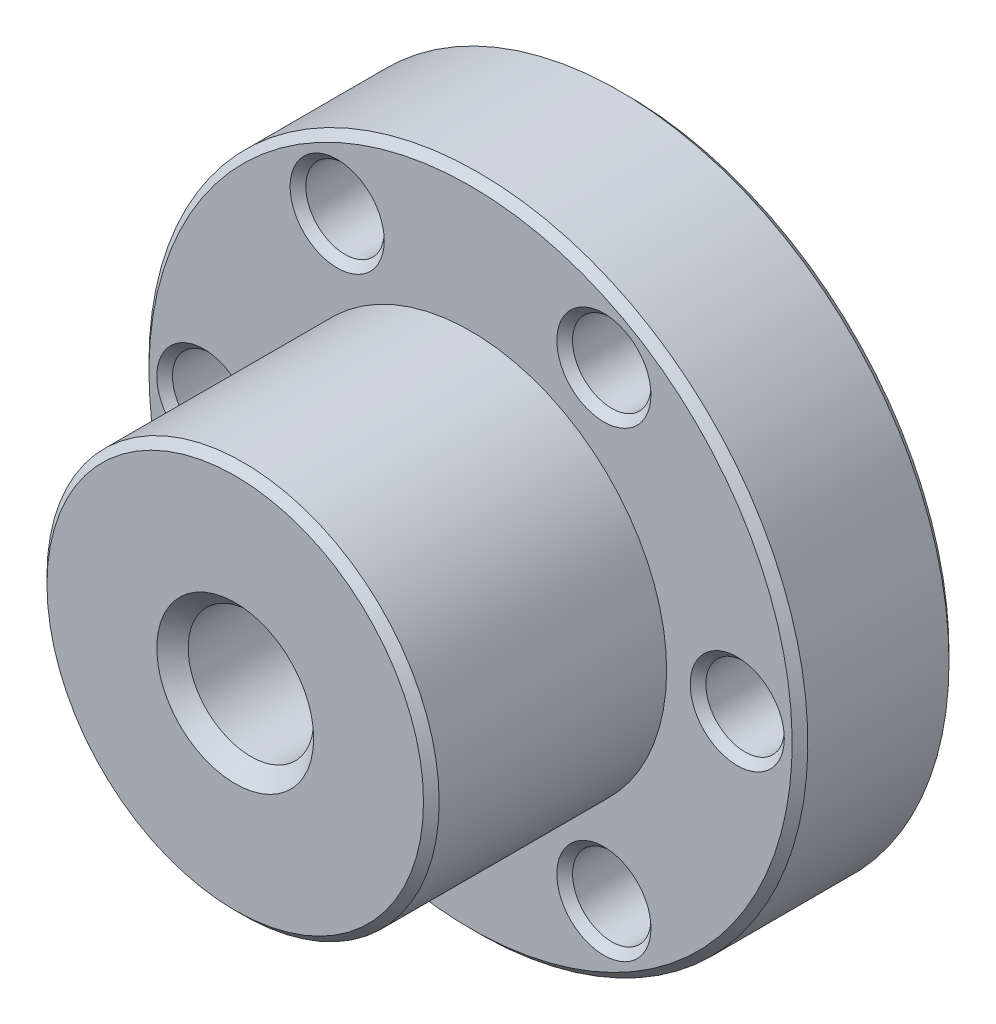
ISO-10303-21;
HEADER;
FILE_DESCRIPTION(('STEP AP214'),'2;1');
FILE_NAME('part.step','',(''),(''),'','','');
FILE_SCHEMA(('AUTOMOTIVE_DESIGN { 1 0 10303 214 1 1 1 1 }'));
ENDSEC;
DATA;
#1=APPLICATION_CONTEXT('core data for automotive mechanical design processes');
#2=APPLICATION_PROTOCOL_DEFINITION('international standard','automotive_design',2000,#1);
#3=PRODUCT_CONTEXT('',#1,'mechanical');
#4=PRODUCT('Part','Part','',(#3));
#5=PRODUCT_RELATED_PRODUCT_CATEGORY('part','',(#4));
#6=PRODUCT_DEFINITION_FORMATION('','',#4);
#7=PRODUCT_DEFINITION_CONTEXT('part definition',#1,'design');
#8=PRODUCT_DEFINITION('design','',#6,#7);
#9=PRODUCT_DEFINITION_SHAPE('','',#8);
#10=(LENGTH_UNIT() NAMED_UNIT(*) SI_UNIT(.MILLI.,.METRE.));
#11=(NAMED_UNIT(*) PLANE_ANGLE_UNIT() SI_UNIT($,.RADIAN.));
#12=(NAMED_UNIT(*) SI_UNIT($,.STERADIAN.) SOLID_ANGLE_UNIT());
#13=UNCERTAINTY_MEASURE_WITH_UNIT(LENGTH_MEASURE(1.E-05),#10,'distance_accuracy_value','');
#14=(GEOMETRIC_REPRESENTATION_CONTEXT(3) GLOBAL_UNCERTAINTY_ASSIGNED_CONTEXT((#13)) GLOBAL_UNIT_ASSIGNED_CONTEXT((#10,
#11,#12)) REPRESENTATION_CONTEXT('',''));
#15=CARTESIAN_POINT('',(0.,0.,0.));
#16=DIRECTION('',(0.,0.,1.));
#17=DIRECTION('',(1.,0.,0.));
#18=AXIS2_PLACEMENT_3D('',#15,#16,#17);
#19=CARTESIAN_POINT('',(0.,0.,12.));
#20=DIRECTION('',(0.,0.,-1.));
#21=DIRECTION('',(-1.,0.,0.));
#22=AXIS2_PLACEMENT_3D('',#19,#20,#21);
#23=CONICAL_SURFACE('',#22,12.5,0.785398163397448);
#24=CARTESIAN_POINT('',(0.,0.,12.));
#25=DIRECTION('',(0.,0.,-1.));
#26=DIRECTION('',(-1.,0.,0.));
#27=AXIS2_PLACEMENT_3D('',#24,#25,#26);
#28=CIRCLE('',#27,12.5);
#29=CARTESIAN_POINT('',(-12.5,0.,12.));
#30=VERTEX_POINT('',#29);
#31=EDGE_CURVE('E30',#30,#30,#28,.T.);
#32=ORIENTED_EDGE('',*,*,#31,.F.);
#33=EDGE_LOOP('',(#32));
#34=FACE_BOUND('',#33,.T.);
#35=CARTESIAN_POINT('',(0.,0.,12.5));
#36=DIRECTION('',(0.,0.,-1.));
#37=DIRECTION('',(-1.,0.,0.));
#38=AXIS2_PLACEMENT_3D('',#35,#36,#37);
#39=CIRCLE('',#38,12.);
#40=CARTESIAN_POINT('',(-12.,0.,12.5));
#41=VERTEX_POINT('',#40);
#42=EDGE_CURVE('E18',#41,#41,#39,.F.);
#43=ORIENTED_EDGE('',*,*,#42,.F.);
#44=EDGE_LOOP('',(#43));
#45=FACE_BOUND('',#44,.T.);
#46=ADVANCED_FACE('F14',(#34,#45),#23,.T.);
#47=CARTESIAN_POINT('',(0.,0.,4.75));
#48=DIRECTION('',(0.,0.,-1.));
#49=DIRECTION('',(-1.,0.,0.));
#50=AXIS2_PLACEMENT_3D('',#47,#48,#49);
#51=CYLINDRICAL_SURFACE('',#50,12.5);
#52=CARTESIAN_POINT('',(0.,0.,-2.5));
#53=DIRECTION('',(0.,0.,-1.));
#54=DIRECTION('',(-1.,0.,0.));
#55=AXIS2_PLACEMENT_3D('',#52,#53,#54);
#56=CIRCLE('',#55,12.5);
#57=CARTESIAN_POINT('',(-12.5,0.,-2.5));
#58=VERTEX_POINT('',#57);
#59=EDGE_CURVE('E75',#58,#58,#56,.T.);
#60=ORIENTED_EDGE('',*,*,#59,.F.);
#61=EDGE_LOOP('',(#60));
#62=FACE_BOUND('',#61,.T.);
#63=ORIENTED_EDGE('',*,*,#31,.T.);
#64=EDGE_LOOP('',(#63));
#65=FACE_BOUND('',#64,.T.);
#66=ADVANCED_FACE('F85',(#62,#65),#51,.T.);
#67=CARTESIAN_POINT('',(8.5,0.,12.5));
#68=DIRECTION('',(0.,0.,1.));
#69=DIRECTION('',(1.,0.,0.));
#70=AXIS2_PLACEMENT_3D('',#67,#68,#69);
#71=PLANE('',#70);
#72=CARTESIAN_POINT('',(0.,0.,12.4999999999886));
#73=DIRECTION('',(0.,0.,1.));
#74=DIRECTION('',(1.,0.,0.));
#75=AXIS2_PLACEMENT_3D('',#72,#73,#74);
#76=CIRCLE('',#75,4.99999999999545);
#77=CARTESIAN_POINT('',(4.99999999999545,0.,12.4999999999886));
#78=VERTEX_POINT('',#77);
#79=EDGE_CURVE('E55',#78,#78,#76,.T.);
#80=ORIENTED_EDGE('',*,*,#79,.F.);
#81=EDGE_LOOP('',(#80));
#82=FACE_BOUND('',#81,.T.);
#83=ORIENTED_EDGE('',*,*,#42,.T.);
#84=EDGE_LOOP('',(#83));
#85=FACE_BOUND('',#84,.T.);
#86=ADVANCED_FACE('F94',(#82,#85),#71,.T.);
#87=CARTESIAN_POINT('',(16.5,0.,-2.5));
#88=DIRECTION('',(0.,0.,1.));
#89=DIRECTION('',(1.,0.,0.));
#90=AXIS2_PLACEMENT_3D('',#87,#88,#89);
#91=PLANE('',#90);
#92=ORIENTED_EDGE('',*,*,#59,.T.);
#93=EDGE_LOOP('',(#92));
#94=FACE_BOUND('',#93,.T.);
#95=CARTESIAN_POINT('',(0.,0.,-2.5));
#96=DIRECTION('',(0.,0.,-1.));
#97=DIRECTION('',(0.,1.,0.));
#98=AXIS2_PLACEMENT_3D('',#95,#96,#97);
#99=CIRCLE('',#98,20.5);
#100=CARTESIAN_POINT('',(0.,20.5,-2.5));
#101=VERTEX_POINT('',#100);
#102=EDGE_CURVE('E51',#101,#101,#99,.T.);
#103=ORIENTED_EDGE('',*,*,#102,.F.);
#104=EDGE_LOOP('',(#103));
#105=FACE_BOUND('',#104,.T.);
#106=CARTESIAN_POINT('',(17.,0.,-2.49999999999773));
#107=DIRECTION('',(0.,0.,1.));
#108=DIRECTION('',(1.,0.,0.));
#109=AXIS2_PLACEMENT_3D('',#106,#107,#108);
#110=CIRCLE('',#109,2.99999999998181);
#111=CARTESIAN_POINT('',(19.9999999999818,0.,-2.49999999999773));
#112=VERTEX_POINT('',#111);
#113=EDGE_CURVE('E58',#112,#112,#110,.F.);
#114=ORIENTED_EDGE('',*,*,#113,.T.);
#115=EDGE_LOOP('',(#114));
#116=FACE_BOUND('',#115,.T.);
#117=CARTESIAN_POINT('',(8.5,14.7224318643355,-2.49999999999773));
#118=DIRECTION('',(0.,0.,1.));
#119=DIRECTION('',(1.,0.,0.));
#120=AXIS2_PLACEMENT_3D('',#117,#118,#119);
#121=CIRCLE('',#120,3.00000000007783);
#122=CARTESIAN_POINT('',(11.5000000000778,14.7224318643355,-2.49999999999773));
#123=VERTEX_POINT('',#122);
#124=EDGE_CURVE('E61',#123,#123,#121,.F.);
#125=ORIENTED_EDGE('',*,*,#124,.T.);
#126=EDGE_LOOP('',(#125));
#127=FACE_BOUND('',#126,.T.);
#128=CARTESIAN_POINT('',(-8.5,14.7224318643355,-2.49999999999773));
#129=DIRECTION('',(0.,0.,1.));
#130=DIRECTION('',(1.,0.,0.));
#131=AXIS2_PLACEMENT_3D('',#128,#129,#130);
#132=CIRCLE('',#131,3.00000000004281);
#133=CARTESIAN_POINT('',(-5.49999999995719,14.7224318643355,-2.49999999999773));
#134=VERTEX_POINT('',#133);
#135=EDGE_CURVE('E64',#134,#134,#132,.F.);
#136=ORIENTED_EDGE('',*,*,#135,.T.);
#137=EDGE_LOOP('',(#136));
#138=FACE_BOUND('',#137,.T.);
#139=CARTESIAN_POINT('',(-17.,0.,-2.49999999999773));
#140=DIRECTION('',(0.,0.,1.));
#141=DIRECTION('',(1.,0.,0.));
#142=AXIS2_PLACEMENT_3D('',#139,#140,#141);
#143=CIRCLE('',#142,2.99999999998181);
#144=CARTESIAN_POINT('',(-14.0000000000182,0.,-2.49999999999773));
#145=VERTEX_POINT('',#144);
#146=EDGE_CURVE('E67',#145,#145,#143,.F.);
#147=ORIENTED_EDGE('',*,*,#146,.T.);
#148=EDGE_LOOP('',(#147));
#149=FACE_BOUND('',#148,.T.);
#150=CARTESIAN_POINT('',(-8.50000000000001,-14.7224318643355,-2.5));
#151=DIRECTION('',(0.,0.,1.));
#152=DIRECTION('',(1.,0.,0.));
#153=AXIS2_PLACEMENT_3D('',#150,#151,#152);
#154=CIRCLE('',#153,3.);
#155=CARTESIAN_POINT('',(-5.5,-14.7224318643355,-2.5));
#156=VERTEX_POINT('',#155);
#157=EDGE_CURVE('E70',#156,#156,#154,.F.);
#158=ORIENTED_EDGE('',*,*,#157,.T.);
#159=EDGE_LOOP('',(#158));
#160=FACE_BOUND('',#159,.T.);
#161=CARTESIAN_POINT('',(8.5,-14.7224318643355,-2.49999999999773));
#162=DIRECTION('',(0.,0.,1.));
#163=DIRECTION('',(1.,0.,0.));
#164=AXIS2_PLACEMENT_3D('',#161,#162,#163);
#165=CIRCLE('',#164,3.00000000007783);
#166=CARTESIAN_POINT('',(11.5000000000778,-14.7224318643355,-2.49999999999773));
#167=VERTEX_POINT('',#166);
#168=EDGE_CURVE('E73',#167,#167,#165,.F.);
#169=ORIENTED_EDGE('',*,*,#168,.T.);
#170=EDGE_LOOP('',(#169));
#171=FACE_BOUND('',#170,.T.);
#172=ADVANCED_FACE('F192',(#94,#105,#116,#127,#138,#149,#160,#171),#91,.T.);
#173=CARTESIAN_POINT('',(8.5,-14.7224318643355,-2.49999999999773));
#174=DIRECTION('',(0.,0.,1.));
#175=DIRECTION('',(1.,0.,0.));
#176=AXIS2_PLACEMENT_3D('',#173,#174,#175);
#177=CONICAL_SURFACE('',#176,3.00000000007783,0.785398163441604);
#178=CARTESIAN_POINT('',(8.5,-14.7224318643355,-2.99999999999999));
#179=DIRECTION('',(0.,0.,-1.));
#180=DIRECTION('',(-1.,0.,0.));
#181=AXIS2_PLACEMENT_3D('',#178,#179,#180);
#182=CIRCLE('',#181,2.5);
#183=CARTESIAN_POINT('',(6.,-14.7224318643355,-2.99999999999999));
#184=VERTEX_POINT('',#183);
#185=EDGE_CURVE('E54',#184,#184,#182,.T.);
#186=ORIENTED_EDGE('',*,*,#185,.T.);
#187=EDGE_LOOP('',(#186));
#188=FACE_BOUND('',#187,.T.);
#189=ORIENTED_EDGE('',*,*,#168,.F.);
#190=EDGE_LOOP('',(#189));
#191=FACE_BOUND('',#190,.T.);
#192=ADVANCED_FACE('F189',(#188,#191),#177,.F.);
#193=CARTESIAN_POINT('',(-8.50000000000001,-14.7224318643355,-3.));
#194=DIRECTION('',(0.,0.,1.));
#195=DIRECTION('',(1.,0.,0.));
#196=AXIS2_PLACEMENT_3D('',#193,#194,#195);
#197=CONICAL_SURFACE('',#196,2.5,0.785398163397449);
#198=CARTESIAN_POINT('',(-8.50000000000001,-14.7224318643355,-3.));
#199=DIRECTION('',(0.,0.,-1.));
#200=DIRECTION('',(-1.,0.,0.));
#201=AXIS2_PLACEMENT_3D('',#198,#199,#200);
#202=CIRCLE('',#201,2.5);
#203=CARTESIAN_POINT('',(-11.,-14.7224318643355,-3.));
#204=VERTEX_POINT('',#203);
#205=EDGE_CURVE('E224',#204,#204,#202,.T.);
#206=ORIENTED_EDGE('',*,*,#205,.T.);
#207=EDGE_LOOP('',(#206));
#208=FACE_BOUND('',#207,.T.);
#209=ORIENTED_EDGE('',*,*,#157,.F.);
#210=EDGE_LOOP('',(#209));
#211=FACE_BOUND('',#210,.T.);
#212=ADVANCED_FACE('F187',(#208,#211),#197,.F.);
#213=CARTESIAN_POINT('',(-17.,0.,-2.50000000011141));
#214=DIRECTION('',(0.,0.,1.));
#215=DIRECTION('',(1.,0.,0.));
#216=AXIS2_PLACEMENT_3D('',#213,#214,#215);
#217=CONICAL_SURFACE('',#216,2.99999999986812,0.785398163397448);
#218=CARTESIAN_POINT('',(-17.,0.,-3.));
#219=DIRECTION('',(0.,0.,-1.));
#220=DIRECTION('',(-1.,0.,0.));
#221=AXIS2_PLACEMENT_3D('',#218,#219,#220);
#222=CIRCLE('',#221,2.5);
#223=CARTESIAN_POINT('',(-19.5,0.,-3.));
#224=VERTEX_POINT('',#223);
#225=EDGE_CURVE('E221',#224,#224,#222,.T.);
#226=ORIENTED_EDGE('',*,*,#225,.T.);
#227=EDGE_LOOP('',(#226));
#228=FACE_BOUND('',#227,.T.);
#229=ORIENTED_EDGE('',*,*,#146,.F.);
#230=EDGE_LOOP('',(#229));
#231=FACE_BOUND('',#230,.T.);
#232=ADVANCED_FACE('F183',(#228,#231),#217,.F.);
#233=CARTESIAN_POINT('',(-8.5,14.7224318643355,-2.49999999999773));
#234=DIRECTION('',(0.,0.,1.));
#235=DIRECTION('',(1.,0.,0.));
#236=AXIS2_PLACEMENT_3D('',#233,#234,#235);
#237=CONICAL_SURFACE('',#236,3.00000000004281,0.78539816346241);
#238=CARTESIAN_POINT('',(-8.5,14.7224318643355,-2.99999999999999));
#239=DIRECTION('',(0.,0.,-1.));
#240=DIRECTION('',(-1.,0.,0.));
#241=AXIS2_PLACEMENT_3D('',#238,#239,#240);
#242=CIRCLE('',#241,2.5);
#243=CARTESIAN_POINT('',(-11.,14.7224318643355,-2.99999999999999));
#244=VERTEX_POINT('',#243);
#245=EDGE_CURVE('E218',#244,#244,#242,.T.);
#246=ORIENTED_EDGE('',*,*,#245,.T.);
#247=EDGE_LOOP('',(#246));
#248=FACE_BOUND('',#247,.T.);
#249=ORIENTED_EDGE('',*,*,#135,.F.);
#250=EDGE_LOOP('',(#249));
#251=FACE_BOUND('',#250,.T.);
#252=ADVANCED_FACE('F179',(#248,#251),#237,.F.);
#253=CARTESIAN_POINT('',(8.5,14.7224318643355,-2.49999999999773));
#254=DIRECTION('',(0.,0.,1.));
#255=DIRECTION('',(1.,0.,0.));
#256=AXIS2_PLACEMENT_3D('',#253,#254,#255);
#257=CONICAL_SURFACE('',#256,3.00000000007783,0.785398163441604);
#258=CARTESIAN_POINT('',(8.5,14.7224318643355,-3.));
#259=DIRECTION('',(0.,0.,-1.));
#260=DIRECTION('',(-1.,0.,0.));
#261=AXIS2_PLACEMENT_3D('',#258,#259,#260);
#262=CIRCLE('',#261,2.5);
#263=CARTESIAN_POINT('',(6.,14.7224318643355,-3.));
#264=VERTEX_POINT('',#263);
#265=EDGE_CURVE('E212',#264,#264,#262,.T.);
#266=ORIENTED_EDGE('',*,*,#265,.T.);
#267=EDGE_LOOP('',(#266));
#268=FACE_BOUND('',#267,.T.);
#269=ORIENTED_EDGE('',*,*,#124,.F.);
#270=EDGE_LOOP('',(#269));
#271=FACE_BOUND('',#270,.T.);
#272=ADVANCED_FACE('F175',(#268,#271),#257,.F.);
#273=CARTESIAN_POINT('',(17.,0.,-2.50000000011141));
#274=DIRECTION('',(0.,0.,1.));
#275=DIRECTION('',(1.,0.,0.));
#276=AXIS2_PLACEMENT_3D('',#273,#274,#275);
#277=CONICAL_SURFACE('',#276,2.99999999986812,0.785398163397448);
#278=CARTESIAN_POINT('',(17.,0.,-3.));
#279=DIRECTION('',(0.,0.,-1.));
#280=DIRECTION('',(-1.,0.,0.));
#281=AXIS2_PLACEMENT_3D('',#278,#279,#280);
#282=CIRCLE('',#281,2.5);
#283=CARTESIAN_POINT('',(14.5,0.,-3.));
#284=VERTEX_POINT('',#283);
#285=EDGE_CURVE('E206',#284,#284,#282,.T.);
#286=ORIENTED_EDGE('',*,*,#285,.T.);
#287=EDGE_LOOP('',(#286));
#288=FACE_BOUND('',#287,.T.);
#289=ORIENTED_EDGE('',*,*,#113,.F.);
#290=EDGE_LOOP('',(#289));
#291=FACE_BOUND('',#290,.T.);
#292=ADVANCED_FACE('F171',(#288,#291),#277,.F.);
#293=CARTESIAN_POINT('',(0.,0.,11.4999999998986));
#294=DIRECTION('',(0.,0.,1.));
#295=DIRECTION('',(1.,0.,0.));
#296=AXIS2_PLACEMENT_3D('',#293,#294,#295);
#297=CONICAL_SURFACE('',#296,3.99999999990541,0.785398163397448);
#298=ORIENTED_EDGE('',*,*,#79,.T.);
#299=EDGE_LOOP('',(#298));
#300=FACE_BOUND('',#299,.T.);
#301=CARTESIAN_POINT('',(0.,0.,11.5));
#302=DIRECTION('',(0.,0.,1.));
#303=DIRECTION('',(1.,0.,0.));
#304=AXIS2_PLACEMENT_3D('',#301,#302,#303);
#305=CIRCLE('',#304,4.);
#306=CARTESIAN_POINT('',(4.,0.,11.5));
#307=VERTEX_POINT('',#306);
#308=EDGE_CURVE('E204',#307,#307,#305,.T.);
#309=ORIENTED_EDGE('',*,*,#308,.F.);
#310=EDGE_LOOP('',(#309));
#311=FACE_BOUND('',#310,.T.);
#312=ADVANCED_FACE('F167',(#300,#311),#297,.F.);
#313=CARTESIAN_POINT('',(0.,0.,-3.));
#314=DIRECTION('',(0.,0.,-1.));
#315=DIRECTION('',(0.,1.,0.));
#316=AXIS2_PLACEMENT_3D('',#313,#314,#315);
#317=CONICAL_SURFACE('',#316,21.,0.785398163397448);
#318=CARTESIAN_POINT('',(0.,0.,-3.));
#319=DIRECTION('',(0.,0.,-1.));
#320=DIRECTION('',(-1.,0.,0.));
#321=AXIS2_PLACEMENT_3D('',#318,#319,#320);
#322=CIRCLE('',#321,21.);
#323=CARTESIAN_POINT('',(-21.,0.,-3.));
#324=VERTEX_POINT('',#323);
#325=EDGE_CURVE('E205',#324,#324,#322,.T.);
#326=ORIENTED_EDGE('',*,*,#325,.F.);
#327=EDGE_LOOP('',(#326));
#328=FACE_BOUND('',#327,.T.);
#329=ORIENTED_EDGE('',*,*,#102,.T.);
#330=EDGE_LOOP('',(#329));
#331=FACE_BOUND('',#330,.T.);
#332=ADVANCED_FACE('F163',(#328,#331),#317,.T.);
#333=CARTESIAN_POINT('',(8.5,-14.7224318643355,-7.49999999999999));
#334=DIRECTION('',(0.,0.,-1.));
#335=DIRECTION('',(-1.,0.,0.));
#336=AXIS2_PLACEMENT_3D('',#333,#334,#335);
#337=CYLINDRICAL_SURFACE('',#336,2.5);
#338=CARTESIAN_POINT('',(8.5,-14.7224318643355,-12.0000000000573));
#339=DIRECTION('',(0.,0.,-1.));
#340=DIRECTION('',(0.499999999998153,-0.866025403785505,0.));
#341=AXIS2_PLACEMENT_3D('',#338,#339,#340);
#342=CIRCLE('',#341,2.5000000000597);
#343=CARTESIAN_POINT('',(9.75000000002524,-16.8874953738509,-12.0000000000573));
#344=VERTEX_POINT('',#343);
#345=EDGE_CURVE('E209',#344,#344,#342,.T.);
#346=ORIENTED_EDGE('',*,*,#345,.T.);
#347=EDGE_LOOP('',(#346));
#348=FACE_BOUND('',#347,.T.);
#349=ORIENTED_EDGE('',*,*,#185,.F.);
#350=EDGE_LOOP('',(#349));
#351=FACE_BOUND('',#350,.T.);
#352=ADVANCED_FACE('F159',(#348,#351),#337,.F.);
#353=CARTESIAN_POINT('',(-8.50000000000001,-14.7224318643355,-7.5));
#354=DIRECTION('',(0.,0.,-1.));
#355=DIRECTION('',(-1.,0.,0.));
#356=AXIS2_PLACEMENT_3D('',#353,#354,#355);
#357=CYLINDRICAL_SURFACE('',#356,2.5);
#358=CARTESIAN_POINT('',(-8.50000000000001,-14.7224318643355,-12.));
#359=DIRECTION('',(0.,0.,-1.));
#360=DIRECTION('',(-1.,0.,0.));
#361=AXIS2_PLACEMENT_3D('',#358,#359,#360);
#362=CIRCLE('',#361,2.5);
#363=CARTESIAN_POINT('',(-11.,-14.7224318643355,-12.));
#364=VERTEX_POINT('',#363);
#365=EDGE_CURVE('E420',#364,#364,#362,.T.);
#366=ORIENTED_EDGE('',*,*,#365,.T.);
#367=EDGE_LOOP('',(#366));
#368=FACE_BOUND('',#367,.T.);
#369=ORIENTED_EDGE('',*,*,#205,.F.);
#370=EDGE_LOOP('',(#369));
#371=FACE_BOUND('',#370,.T.);
#372=ADVANCED_FACE('F155',(#368,#371),#357,.F.);
#373=CARTESIAN_POINT('',(-17.,0.,-7.5));
#374=DIRECTION('',(0.,0.,-1.));
#375=DIRECTION('',(-1.,0.,0.));
#376=AXIS2_PLACEMENT_3D('',#373,#374,#375);
#377=CYLINDRICAL_SURFACE('',#376,2.5);
#378=CARTESIAN_POINT('',(-17.,0.,-11.9999999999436));
#379=DIRECTION('',(0.,0.,-1.));
#380=DIRECTION('',(-1.,0.,0.));
#381=AXIS2_PLACEMENT_3D('',#378,#379,#380);
#382=CIRCLE('',#381,2.49999999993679);
#383=CARTESIAN_POINT('',(-19.4999999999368,0.,-11.9999999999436));
#384=VERTEX_POINT('',#383);
#385=EDGE_CURVE('E421',#384,#384,#382,.T.);
#386=ORIENTED_EDGE('',*,*,#385,.T.);
#387=EDGE_LOOP('',(#386));
#388=FACE_BOUND('',#387,.T.);
#389=ORIENTED_EDGE('',*,*,#225,.F.);
#390=EDGE_LOOP('',(#389));
#391=FACE_BOUND('',#390,.T.);
#392=ADVANCED_FACE('F151',(#388,#391),#377,.F.);
#393=CARTESIAN_POINT('',(-8.5,14.7224318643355,-7.49999999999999));
#394=DIRECTION('',(0.,0.,-1.));
#395=DIRECTION('',(-1.,0.,0.));
#396=AXIS2_PLACEMENT_3D('',#393,#394,#395);
#397=CYLINDRICAL_SURFACE('',#396,2.5);
#398=CARTESIAN_POINT('',(-8.5,14.7224318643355,-12.0000000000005));
#399=DIRECTION('',(0.,0.,-1.));
#400=DIRECTION('',(-0.499999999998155,0.866025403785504,0.));
#401=AXIS2_PLACEMENT_3D('',#398,#399,#400);
#402=CIRCLE('',#401,2.50000000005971);
#403=CARTESIAN_POINT('',(-9.75000000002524,16.8874953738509,-12.0000000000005));
#404=VERTEX_POINT('',#403);
#405=EDGE_CURVE('E424',#404,#404,#402,.T.);
#406=ORIENTED_EDGE('',*,*,#405,.T.);
#407=EDGE_LOOP('',(#406));
#408=FACE_BOUND('',#407,.T.);
#409=ORIENTED_EDGE('',*,*,#245,.F.);
#410=EDGE_LOOP('',(#409));
#411=FACE_BOUND('',#410,.T.);
#412=ADVANCED_FACE('F147',(#408,#411),#397,.F.);
#413=CARTESIAN_POINT('',(8.5,14.7224318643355,-7.5));
#414=DIRECTION('',(0.,0.,-1.));
#415=DIRECTION('',(-1.,0.,0.));
#416=AXIS2_PLACEMENT_3D('',#413,#414,#415);
#417=CYLINDRICAL_SURFACE('',#416,2.5);
#418=CARTESIAN_POINT('',(8.5,14.7224318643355,-12.0000000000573));
#419=DIRECTION('',(0.,0.,-1.));
#420=DIRECTION('',(0.499999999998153,0.866025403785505,0.));
#421=AXIS2_PLACEMENT_3D('',#418,#419,#420);
#422=CIRCLE('',#421,2.5000000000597);
#423=CARTESIAN_POINT('',(9.75000000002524,16.8874953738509,-12.0000000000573));
#424=VERTEX_POINT('',#423);
#425=EDGE_CURVE('E430',#424,#424,#422,.T.);
#426=ORIENTED_EDGE('',*,*,#425,.T.);
#427=EDGE_LOOP('',(#426));
#428=FACE_BOUND('',#427,.T.);
#429=ORIENTED_EDGE('',*,*,#265,.F.);
#430=EDGE_LOOP('',(#429));
#431=FACE_BOUND('',#430,.T.);
#432=ADVANCED_FACE('F143',(#428,#431),#417,.F.);
#433=CARTESIAN_POINT('',(17.,0.,-7.5));
#434=DIRECTION('',(0.,0.,-1.));
#435=DIRECTION('',(-1.,0.,0.));
#436=AXIS2_PLACEMENT_3D('',#433,#434,#435);
#437=CYLINDRICAL_SURFACE('',#436,2.5);
#438=CARTESIAN_POINT('',(17.,0.,-11.9999999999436));
#439=DIRECTION('',(0.,0.,-1.));
#440=DIRECTION('',(1.,0.,0.));
#441=AXIS2_PLACEMENT_3D('',#438,#439,#440);
#442=CIRCLE('',#441,2.49999999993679);
#443=CARTESIAN_POINT('',(19.4999999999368,0.,-11.9999999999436));
#444=VERTEX_POINT('',#443);
#445=EDGE_CURVE('E433',#444,#444,#442,.T.);
#446=ORIENTED_EDGE('',*,*,#445,.T.);
#447=EDGE_LOOP('',(#446));
#448=FACE_BOUND('',#447,.T.);
#449=ORIENTED_EDGE('',*,*,#285,.F.);
#450=EDGE_LOOP('',(#449));
#451=FACE_BOUND('',#450,.T.);
#452=ADVANCED_FACE('F139',(#448,#451),#437,.F.);
#453=CARTESIAN_POINT('',(0.,0.,11.5));
#454=DIRECTION('',(0.,0.,-1.));
#455=DIRECTION('',(-1.,0.,0.));
#456=AXIS2_PLACEMENT_3D('',#453,#454,#455);
#457=CYLINDRICAL_SURFACE('',#456,4.);
#458=ORIENTED_EDGE('',*,*,#308,.T.);
#459=EDGE_LOOP('',(#458));
#460=FACE_BOUND('',#459,.T.);
#461=CARTESIAN_POINT('',(0.,0.,-11.4999999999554));
#462=DIRECTION('',(0.,0.,-1.));
#463=DIRECTION('',(1.,0.,0.));
#464=AXIS2_PLACEMENT_3D('',#461,#462,#463);
#465=CIRCLE('',#464,3.99999999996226);
#466=CARTESIAN_POINT('',(3.99999999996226,0.,-11.4999999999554));
#467=VERTEX_POINT('',#466);
#468=EDGE_CURVE('E436',#467,#467,#465,.F.);
#469=ORIENTED_EDGE('',*,*,#468,.F.);
#470=EDGE_LOOP('',(#469));
#471=FACE_BOUND('',#470,.T.);
#472=ADVANCED_FACE('F135',(#460,#471),#457,.F.);
#473=CARTESIAN_POINT('',(0.,0.,-7.5));
#474=DIRECTION('',(0.,0.,-1.));
#475=DIRECTION('',(-1.,0.,0.));
#476=AXIS2_PLACEMENT_3D('',#473,#474,#475);
#477=CYLINDRICAL_SURFACE('',#476,21.);
#478=CARTESIAN_POINT('',(0.,0.,-12.));
#479=DIRECTION('',(0.,0.,1.));
#480=DIRECTION('',(1.,0.,0.));
#481=AXIS2_PLACEMENT_3D('',#478,#479,#480);
#482=CIRCLE('',#481,21.);
#483=CARTESIAN_POINT('',(21.,0.,-12.));
#484=VERTEX_POINT('',#483);
#485=EDGE_CURVE('E50',#484,#484,#482,.F.);
#486=ORIENTED_EDGE('',*,*,#485,.F.);
#487=EDGE_LOOP('',(#486));
#488=FACE_BOUND('',#487,.T.);
#489=ORIENTED_EDGE('',*,*,#325,.T.);
#490=EDGE_LOOP('',(#489));
#491=FACE_BOUND('',#490,.T.);
#492=ADVANCED_FACE('F131',(#488,#491),#477,.T.);
#493=CARTESIAN_POINT('',(8.5,-14.7224318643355,-12.4999999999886));
#494=DIRECTION('',(0.,0.,-1.));
#495=DIRECTION('',(-1.,0.,0.));
#496=AXIS2_PLACEMENT_3D('',#493,#494,#495);
#497=CONICAL_SURFACE('',#496,2.99999999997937,0.785398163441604);
#498=CARTESIAN_POINT('',(8.5,-14.7224318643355,-12.4999999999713));
#499=DIRECTION('',(0.,0.,-1.));
#500=DIRECTION('',(-1.,0.,0.));
#501=AXIS2_PLACEMENT_3D('',#498,#499,#500);
#502=CIRCLE('',#501,2.99999999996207);
#503=CARTESIAN_POINT('',(5.50000000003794,-14.7224318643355,-12.4999999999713));
#504=VERTEX_POINT('',#503);
#505=EDGE_CURVE('E47',#504,#504,#502,.F.);
#506=ORIENTED_EDGE('',*,*,#505,.F.);
#507=EDGE_LOOP('',(#506));
#508=FACE_BOUND('',#507,.T.);
#509=ORIENTED_EDGE('',*,*,#345,.F.);
#510=EDGE_LOOP('',(#509));
#511=FACE_BOUND('',#510,.T.);
#512=ADVANCED_FACE('F128',(#508,#511),#497,.F.);
#513=CARTESIAN_POINT('',(-8.5,-14.7224318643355,-12.5));
#514=DIRECTION('',(0.,0.,-1.));
#515=DIRECTION('',(-1.,0.,0.));
#516=AXIS2_PLACEMENT_3D('',#513,#514,#515);
#517=CONICAL_SURFACE('',#516,3.,0.785398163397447);
#518=CARTESIAN_POINT('',(-8.5,-14.7224318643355,-12.5));
#519=DIRECTION('',(0.,0.,-1.));
#520=DIRECTION('',(-1.,0.,0.));
#521=AXIS2_PLACEMENT_3D('',#518,#519,#520);
#522=CIRCLE('',#521,3.);
#523=CARTESIAN_POINT('',(-11.5,-14.7224318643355,-12.5));
#524=VERTEX_POINT('',#523);
#525=EDGE_CURVE('E44',#524,#524,#522,.F.);
#526=ORIENTED_EDGE('',*,*,#525,.F.);
#527=EDGE_LOOP('',(#526));
#528=FACE_BOUND('',#527,.T.);
#529=ORIENTED_EDGE('',*,*,#365,.F.);
#530=EDGE_LOOP('',(#529));
#531=FACE_BOUND('',#530,.T.);
#532=ADVANCED_FACE('F16',(#528,#531),#517,.F.);
#533=CARTESIAN_POINT('',(-17.,0.,-12.4999999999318));
#534=DIRECTION('',(0.,0.,-1.));
#535=DIRECTION('',(0.,1.,0.));
#536=AXIS2_PLACEMENT_3D('',#533,#534,#535);
#537=CONICAL_SURFACE('',#536,2.99999999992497,0.785398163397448);
#538=CARTESIAN_POINT('',(-17.,0.,-12.5000000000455));
#539=DIRECTION('',(0.,0.,-1.));
#540=DIRECTION('',(0.,1.,0.));
#541=AXIS2_PLACEMENT_3D('',#538,#539,#540);
#542=CIRCLE('',#541,3.00000000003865);
#543=CARTESIAN_POINT('',(-17.,3.00000000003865,-12.5000000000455));
#544=VERTEX_POINT('',#543);
#545=EDGE_CURVE('E41',#544,#544,#542,.F.);
#546=ORIENTED_EDGE('',*,*,#545,.F.);
#547=EDGE_LOOP('',(#546));
#548=FACE_BOUND('',#547,.T.);
#549=ORIENTED_EDGE('',*,*,#385,.F.);
#550=EDGE_LOOP('',(#549));
#551=FACE_BOUND('',#550,.T.);
#552=ADVANCED_FACE('F123',(#548,#551),#537,.F.);
#553=CARTESIAN_POINT('',(-8.5,14.7224318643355,-12.4999999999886));
#554=DIRECTION('',(0.,0.,-1.));
#555=DIRECTION('',(-1.,0.,0.));
#556=AXIS2_PLACEMENT_3D('',#553,#554,#555);
#557=CONICAL_SURFACE('',#556,3.00000000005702,0.785398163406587);
#558=CARTESIAN_POINT('',(-8.5,14.7224318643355,-12.4999999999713));
#559=DIRECTION('',(0.,0.,-1.));
#560=DIRECTION('',(-1.,0.,0.));
#561=AXIS2_PLACEMENT_3D('',#558,#559,#560);
#562=CIRCLE('',#561,3.00000000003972);
#563=CARTESIAN_POINT('',(-11.5000000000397,14.7224318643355,-12.4999999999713));
#564=VERTEX_POINT('',#563);
#565=EDGE_CURVE('E38',#564,#564,#562,.F.);
#566=ORIENTED_EDGE('',*,*,#565,.F.);
#567=EDGE_LOOP('',(#566));
#568=FACE_BOUND('',#567,.T.);
#569=ORIENTED_EDGE('',*,*,#405,.F.);
#570=EDGE_LOOP('',(#569));
#571=FACE_BOUND('',#570,.T.);
#572=ADVANCED_FACE('F119',(#568,#571),#557,.F.);
#573=CARTESIAN_POINT('',(8.5,14.7224318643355,-12.4999999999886));
#574=DIRECTION('',(0.,0.,-1.));
#575=DIRECTION('',(-1.,0.,0.));
#576=AXIS2_PLACEMENT_3D('',#573,#574,#575);
#577=CONICAL_SURFACE('',#576,2.99999999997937,0.785398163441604);
#578=CARTESIAN_POINT('',(8.5,14.7224318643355,-12.4999999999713));
#579=DIRECTION('',(0.,0.,-1.));
#580=DIRECTION('',(-1.,0.,0.));
#581=AXIS2_PLACEMENT_3D('',#578,#579,#580);
#582=CIRCLE('',#581,2.99999999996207);
#583=CARTESIAN_POINT('',(5.50000000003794,14.7224318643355,-12.4999999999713));
#584=VERTEX_POINT('',#583);
#585=EDGE_CURVE('E35',#584,#584,#582,.F.);
#586=ORIENTED_EDGE('',*,*,#585,.F.);
#587=EDGE_LOOP('',(#586));
#588=FACE_BOUND('',#587,.T.);
#589=ORIENTED_EDGE('',*,*,#425,.F.);
#590=EDGE_LOOP('',(#589));
#591=FACE_BOUND('',#590,.T.);
#592=ADVANCED_FACE('F115',(#588,#591),#577,.F.);
#593=CARTESIAN_POINT('',(17.,0.,-12.4999999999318));
#594=DIRECTION('',(0.,0.,-1.));
#595=DIRECTION('',(0.,1.,0.));
#596=AXIS2_PLACEMENT_3D('',#593,#594,#595);
#597=CONICAL_SURFACE('',#596,2.99999999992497,0.785398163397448);
#598=CARTESIAN_POINT('',(17.,0.,-12.5000000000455));
#599=DIRECTION('',(0.,0.,-1.));
#600=DIRECTION('',(0.,1.,0.));
#601=AXIS2_PLACEMENT_3D('',#598,#599,#600);
#602=CIRCLE('',#601,3.00000000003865);
#603=CARTESIAN_POINT('',(17.,3.00000000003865,-12.5000000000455));
#604=VERTEX_POINT('',#603);
#605=EDGE_CURVE('E27',#604,#604,#602,.F.);
#606=ORIENTED_EDGE('',*,*,#605,.F.);
#607=EDGE_LOOP('',(#606));
#608=FACE_BOUND('',#607,.T.);
#609=ORIENTED_EDGE('',*,*,#445,.F.);
#610=EDGE_LOOP('',(#609));
#611=FACE_BOUND('',#610,.T.);
#612=ADVANCED_FACE('F111',(#608,#611),#597,.F.);
#613=CARTESIAN_POINT('',(0.,0.,-11.4999999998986));
#614=DIRECTION('',(0.,0.,-1.));
#615=DIRECTION('',(-1.,0.,0.));
#616=AXIS2_PLACEMENT_3D('',#613,#614,#615);
#617=CONICAL_SURFACE('',#616,3.99999999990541,0.785398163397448);
#618=ORIENTED_EDGE('',*,*,#468,.T.);
#619=EDGE_LOOP('',(#618));
#620=FACE_BOUND('',#619,.T.);
#621=CARTESIAN_POINT('',(0.,0.,-12.4999999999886));
#622=DIRECTION('',(0.,0.,-1.));
#623=DIRECTION('',(-1.,0.,0.));
#624=AXIS2_PLACEMENT_3D('',#621,#622,#623);
#625=CIRCLE('',#624,4.99999999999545);
#626=CARTESIAN_POINT('',(-4.99999999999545,0.,-12.4999999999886));
#627=VERTEX_POINT('',#626);
#628=EDGE_CURVE('E22',#627,#627,#625,.F.);
#629=ORIENTED_EDGE('',*,*,#628,.F.);
#630=EDGE_LOOP('',(#629));
#631=FACE_BOUND('',#630,.T.);
#632=ADVANCED_FACE('F104',(#620,#631),#617,.F.);
#633=CARTESIAN_POINT('',(0.,0.,-12.));
#634=DIRECTION('',(0.,0.,1.));
#635=DIRECTION('',(0.,-1.,0.));
#636=AXIS2_PLACEMENT_3D('',#633,#634,#635);
#637=CONICAL_SURFACE('',#636,21.,0.785398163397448);
#638=CARTESIAN_POINT('',(0.,0.,-12.5));
#639=DIRECTION('',(0.,0.,1.));
#640=DIRECTION('',(0.,-1.,0.));
#641=AXIS2_PLACEMENT_3D('',#638,#639,#640);
#642=CIRCLE('',#641,20.5);
#643=CARTESIAN_POINT('',(0.,-20.5,-12.5));
#644=VERTEX_POINT('',#643);
#645=EDGE_CURVE('E9',#644,#644,#642,.F.);
#646=ORIENTED_EDGE('',*,*,#645,.F.);
#647=EDGE_LOOP('',(#646));
#648=FACE_BOUND('',#647,.T.);
#649=ORIENTED_EDGE('',*,*,#485,.T.);
#650=EDGE_LOOP('',(#649));
#651=FACE_BOUND('',#650,.T.);
#652=ADVANCED_FACE('F99',(#648,#651),#637,.T.);
#653=CARTESIAN_POINT('',(12.75,0.,-12.5));
#654=DIRECTION('',(0.,0.,-1.));
#655=DIRECTION('',(-1.,0.,0.));
#656=AXIS2_PLACEMENT_3D('',#653,#654,#655);
#657=PLANE('',#656);
#658=ORIENTED_EDGE('',*,*,#645,.T.);
#659=EDGE_LOOP('',(#658));
#660=FACE_BOUND('',#659,.T.);
#661=ORIENTED_EDGE('',*,*,#628,.T.);
#662=EDGE_LOOP('',(#661));
#663=FACE_BOUND('',#662,.T.);
#664=ORIENTED_EDGE('',*,*,#605,.T.);
#665=EDGE_LOOP('',(#664));
#666=FACE_BOUND('',#665,.T.);
#667=ORIENTED_EDGE('',*,*,#585,.T.);
#668=EDGE_LOOP('',(#667));
#669=FACE_BOUND('',#668,.T.);
#670=ORIENTED_EDGE('',*,*,#565,.T.);
#671=EDGE_LOOP('',(#670));
#672=FACE_BOUND('',#671,.T.);
#673=ORIENTED_EDGE('',*,*,#545,.T.);
#674=EDGE_LOOP('',(#673));
#675=FACE_BOUND('',#674,.T.);
#676=ORIENTED_EDGE('',*,*,#525,.T.);
#677=EDGE_LOOP('',(#676));
#678=FACE_BOUND('',#677,.T.);
#679=ORIENTED_EDGE('',*,*,#505,.T.);
#680=EDGE_LOOP('',(#679));
#681=FACE_BOUND('',#680,.T.);
#682=ADVANCED_FACE('F97',(#660,#663,#666,#669,#672,#675,#678,#681),#657,.T.);
#683=CLOSED_SHELL('',(#46,#66,#86,#172,#192,#212,#232,#252,#272,#292,#312,#332,#352,#372,#392,
#412,#432,#452,#472,#492,#512,#532,#552,#572,#592,#612,#632,#652,#682));
#684=MANIFOLD_SOLID_BREP('B1',#683);
#685=ADVANCED_BREP_SHAPE_REPRESENTATION('',(#18,#684),#14);
#686=SHAPE_DEFINITION_REPRESENTATION(#9,#685);
ENDSEC;
END-ISO-10303-21;
